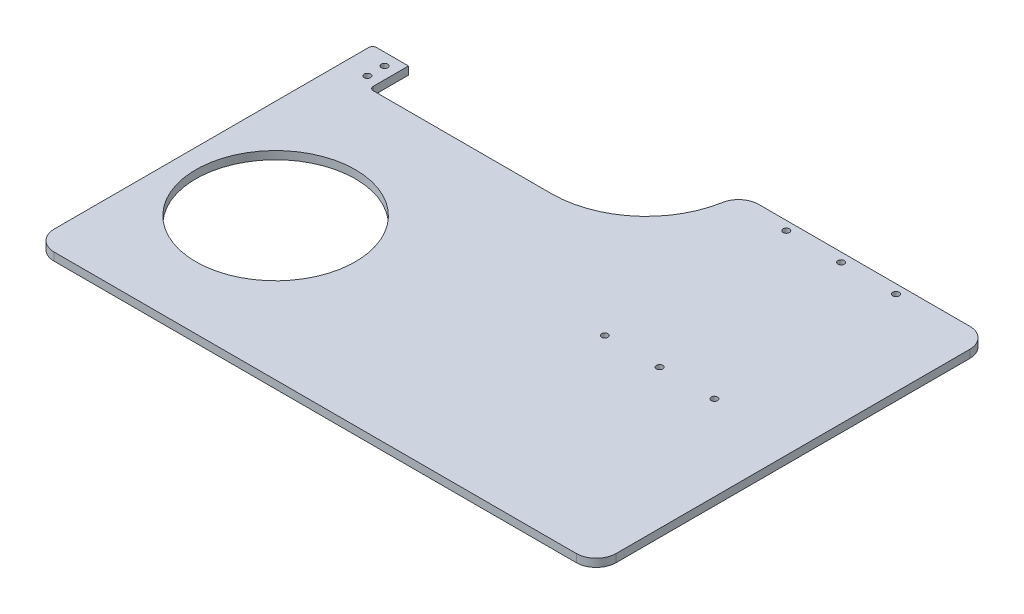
from build123d import *

# Parameters (mm, degrees)
ESBO_O1_W                = 400
ESBO_O1_H                = 250
RESSALTO_EXTRUS_O1_DEPTH = 4
ESBO_O4_W                = 400
ESBO_O4_H                = 250
CORTE_EXTRUS_O2_DEPTH    = 4
CORTE_EXTRUS_O3_REACH    = 273.782
ESBO_O5_R                = 1.6
ESBO_O5_R_2              = 40


with BuildPart() as part:
    # Esbo_o1 → Ressalto-extrus_o1 (new body)
    with BuildSketch(Plane(origin=(0, 0, 0), x_dir=(1, 0, 0), z_dir=(0, 1, 0))):
        with Locations((125, 25)):
            Rectangle(ESBO_O1_W, ESBO_O1_H)
    extrude(amount=RESSALTO_EXTRUS_O1_DEPTH)

    # Esbo_o4 → Corte-extrus_o2 (cut)
    with BuildSketch(Plane(origin=(0, 4, 0), x_dir=(1, 0, 0), z_dir=(0, 1, 0))):
        with Locations((125, 25)):
            Rectangle(ESBO_O4_W, ESBO_O4_H)
        with BuildLine():
            Line((-30.803769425, 112.32061), (-30.803769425, 94.7051))
            ThreePointArc((-30.803769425, 94.7051), (-30.217982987, 93.290886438), (-28.803769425, 92.7051))
            Line((-28.803769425, 92.7051), (60.620483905, 92.7051))
            ThreePointArc((60.620483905, 92.7051), (91.004731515, 103.756310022), (107.189448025, 131.745356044))
            ThreePointArc((107.189448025, 131.745356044), (110.611532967, 137.663340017), (117.035956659, 140))
            Line((117.035956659, 140), (222.915383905, 140))
            ThreePointArc((222.915383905, 140), (229.986451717, 137.071067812), (232.915383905, 130))
            Line((232.915383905, 130), (232.915383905, -47.2949))
            ThreePointArc((232.915383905, -47.2949), (229.986451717, -54.365967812), (222.915383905, -57.2949))
            Line((222.915383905, -57.2949), (-38.803769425, -57.2949))
            ThreePointArc((-38.803769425, -57.2949), (-45.874837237, -54.365967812), (-48.803769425, -47.2949))
            Line((-48.803769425, -47.2949), (-48.803769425, 110.32061))
            ThreePointArc((-48.803769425, 110.32061), (-48.217982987, 111.734823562), (-46.803769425, 112.32061))
            Line((-46.803769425, 112.32061), (-30.803769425, 112.32061))
        make_face(mode=Mode.SUBTRACT)
    extrude(amount=-CORTE_EXTRUS_O2_DEPTH, mode=Mode.SUBTRACT)

    # Esbo_o5 → Corte-extrus_o3 (cut, up to next)
    with BuildSketch(Plane(origin=(0, 4, 0), x_dir=(1, 0, 0), z_dir=(0, 1, 0)), mode=Mode.PRIVATE) as corte_extrus_o3_sk1:
        with Locations(Location((-36.803769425, 106.32061, 0), (0, 0, 270))):
            Circle(ESBO_O5_R)
    corte_extrus_o3_tool1 = extrude(corte_extrus_o3_sk1.sketch, amount=-CORTE_EXTRUS_O3_REACH, mode=Mode.PRIVATE) & part.part
    # Esbo_o5 → Corte-extrus_o3 (cut, up to next)
    with BuildSketch(Plane(origin=(0, 4, 0), x_dir=(1, 0, 0), z_dir=(0, 1, 0)), mode=Mode.PRIVATE) as corte_extrus_o3_sk2:
        with Locations(Location((-36.803769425, 97.72061, 0), (0, 0, 270))):
            Circle(ESBO_O5_R)
    corte_extrus_o3_tool2 = extrude(corte_extrus_o3_sk2.sketch, amount=-CORTE_EXTRUS_O3_REACH, mode=Mode.PRIVATE) & part.part
    # Esbo_o5 → Corte-extrus_o3 (cut, up to next)
    with BuildSketch(Plane(origin=(0, 4, 0), x_dir=(1, 0, 0), z_dir=(0, 1, 0)), mode=Mode.PRIVATE) as corte_extrus_o3_sk3:
        with Locations(Location((135.415383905, 135.5, 0), (0, 0, 270))):
            Circle(ESBO_O5_R)
    corte_extrus_o3_tool3 = extrude(corte_extrus_o3_sk3.sketch, amount=-CORTE_EXTRUS_O3_REACH, mode=Mode.PRIVATE) & part.part
    # Esbo_o5 → Corte-extrus_o3 (cut, up to next)
    with BuildSketch(Plane(origin=(0, 4, 0), x_dir=(1, 0, 0), z_dir=(0, 1, 0)), mode=Mode.PRIVATE) as corte_extrus_o3_sk4:
        with Locations(Location((162.915383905, 135.5, 0), (0, 0, 270))):
            Circle(ESBO_O5_R)
    corte_extrus_o3_tool4 = extrude(corte_extrus_o3_sk4.sketch, amount=-CORTE_EXTRUS_O3_REACH, mode=Mode.PRIVATE) & part.part
    # Esbo_o5 → Corte-extrus_o3 (cut, up to next)
    with BuildSketch(Plane(origin=(0, 4, 0), x_dir=(1, 0, 0), z_dir=(0, 1, 0)), mode=Mode.PRIVATE) as corte_extrus_o3_sk5:
        with Locations(Location((190.415383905, 135.5, 0), (0, 0, 270))):
            Circle(ESBO_O5_R)
    corte_extrus_o3_tool5 = extrude(corte_extrus_o3_sk5.sketch, amount=-CORTE_EXTRUS_O3_REACH, mode=Mode.PRIVATE) & part.part
    # Esbo_o5 → Corte-extrus_o3 (cut, up to next)
    with BuildSketch(Plane(origin=(0, 4, 0), x_dir=(1, 0, 0), z_dir=(0, 1, 0)), mode=Mode.PRIVATE) as corte_extrus_o3_sk6:
        with Locations(Location((190.415383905, 44.5, 0), (0, 0, 270))):
            Circle(ESBO_O5_R)
    corte_extrus_o3_tool6 = extrude(corte_extrus_o3_sk6.sketch, amount=-CORTE_EXTRUS_O3_REACH, mode=Mode.PRIVATE) & part.part
    # Esbo_o5 → Corte-extrus_o3 (cut, up to next)
    with BuildSketch(Plane(origin=(0, 4, 0), x_dir=(1, 0, 0), z_dir=(0, 1, 0)), mode=Mode.PRIVATE) as corte_extrus_o3_sk7:
        with Locations(Location((162.915383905, 44.5, 0), (0, 0, 270))):
            Circle(ESBO_O5_R)
    corte_extrus_o3_tool7 = extrude(corte_extrus_o3_sk7.sketch, amount=-CORTE_EXTRUS_O3_REACH, mode=Mode.PRIVATE) & part.part
    # Esbo_o5 → Corte-extrus_o3 (cut, up to next)
    with BuildSketch(Plane(origin=(0, 4, 0), x_dir=(1, 0, 0), z_dir=(0, 1, 0)), mode=Mode.PRIVATE) as corte_extrus_o3_sk8:
        with Locations(Location((135.415383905, 44.5, 0), (0, 0, 270))):
            Circle(ESBO_O5_R)
    corte_extrus_o3_tool8 = extrude(corte_extrus_o3_sk8.sketch, amount=-CORTE_EXTRUS_O3_REACH, mode=Mode.PRIVATE) & part.part
    # Esbo_o5 → Corte-extrus_o3 (cut, up to next)
    with BuildSketch(Plane(origin=(0, 4, 0), x_dir=(1, 0, 0), z_dir=(0, 1, 0)), mode=Mode.PRIVATE) as corte_extrus_o3_sk9:
        with Locations(Location((0.896230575, 14, 0), (0, 0, 270))):
            Circle(ESBO_O5_R_2)
    corte_extrus_o3_tool9 = extrude(corte_extrus_o3_sk9.sketch, amount=-CORTE_EXTRUS_O3_REACH, mode=Mode.PRIVATE) & part.part
    add(corte_extrus_o3_tool1.solids().sort_by_distance((-36.803769, 4, -106.32061))[0], mode=Mode.SUBTRACT)
    add(corte_extrus_o3_tool2.solids().sort_by_distance((-36.803769, 4, -97.72061))[0], mode=Mode.SUBTRACT)
    add(corte_extrus_o3_tool3.solids().sort_by_distance((135.415384, 4, -135.5))[0], mode=Mode.SUBTRACT)
    add(corte_extrus_o3_tool4.solids().sort_by_distance((162.915384, 4, -135.5))[0], mode=Mode.SUBTRACT)
    add(corte_extrus_o3_tool5.solids().sort_by_distance((190.415384, 4, -135.5))[0], mode=Mode.SUBTRACT)
    add(corte_extrus_o3_tool6.solids().sort_by_distance((190.415384, 4, -44.5))[0], mode=Mode.SUBTRACT)
    add(corte_extrus_o3_tool7.solids().sort_by_distance((162.915384, 4, -44.5))[0], mode=Mode.SUBTRACT)
    add(corte_extrus_o3_tool8.solids().sort_by_distance((135.415384, 4, -44.5))[0], mode=Mode.SUBTRACT)
    add(corte_extrus_o3_tool9.solids().sort_by_distance((0.896231, 4, -14))[0], mode=Mode.SUBTRACT)


solid = part.part
